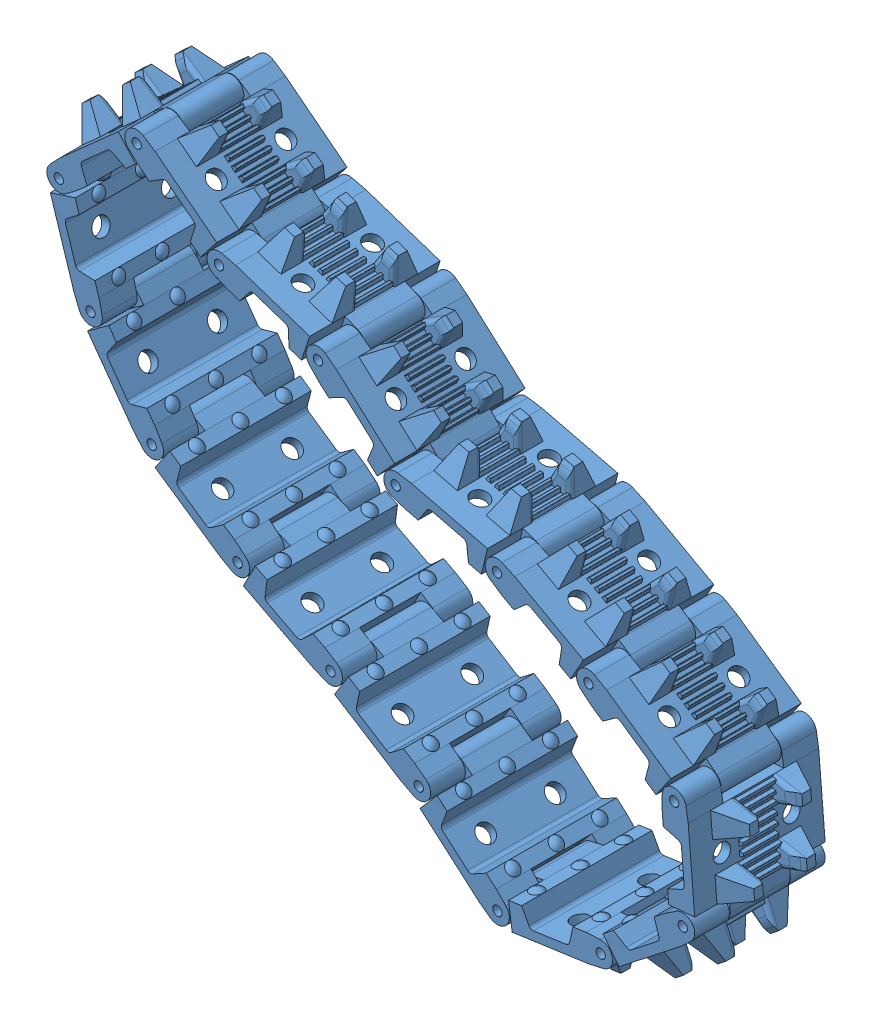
SolidWorks assembly Assemblage1.sldasm, configuration Défaut (file format 8000). Lengths in mm.
Overall size (162.13 129.48 30).
16 component instances, 1 part files, 31 mates.
Components (placement in the parent):
- Track V2.0-1: Track V2.0.SLDPRT [Défaut] at (-161.0772 34.4035 -52.2427) x (0.746642 0.665226 0) z (0 0 1) size (29.5 12.7 30)
- Track V2.0-2: Track V2.0.SLDPRT [Défaut] at (-142.6591 35.0011 -52.2427) x (0.788197 -0.615423 0) z (0 0 1) size (29.5 12.7 30)
- Track V2.0-3: Track V2.0.SLDPRT [Défaut] at (-166.3934 14.9873 -52.2427) x (-0.303624 0.952792 0) z (0 0 1) size (29.5 12.7 30)
- Track V2.0-4: Track V2.0.SLDPRT [Défaut] at (-155.7079 -6.1627 -52.2427) x (-0.586838 0.809705 0) z (0 0 1) size (29.5 12.7 30)
- Track V2.0-5: Track V2.0.SLDPRT [Défaut] at (-78.1946 -61.1357 -52.2427) x (-0.754356 0.656465 0) z (0 0 1) size (29.5 12.7 30)
- Track V2.0-6: Track V2.0.SLDPRT [Défaut] at (-97.3963 -46.8559 -52.2427) x (-0.845786 0.533522 0) z (0 0 1) size (29.5 12.7 30)
- Track V2.0-7: Track V2.0.SLDPRT [Défaut] at (-118.2154 -34.9619 -52.2427) x (-0.889137 0.457641 0) z (0 0 1) size (29.5 12.7 30)
- Track V2.0-8: Track V2.0.SLDPRT [Défaut] at (-138.7754 -22.6747 -52.2427) x (-0.824202 0.566296 0) z (0 0 1) size (29.5 12.7 30)
- Track V2.0-9: Track V2.0.SLDPRT [Défaut] at (-121.8102 23.8406 -52.2427) x (0.949218 -0.31462 0) z (0 0 1) size (29.5 12.7 30)
- Track V2.0-10: Track V2.0.SLDPRT [Défaut] at (-101.485 12.0543 -52.2427) x (0.744545 -0.667572 0) z (0 0 1) size (29.5 12.7 30)
- Track V2.0-11: Track V2.0.SLDPRT [Défaut] at (-35.9453 -58.2242 -52.2427) x (-0.786293 -0.617854 0) z (0 0 1) size (29.5 12.7 30)
- Track V2.0-12: Track V2.0.SLDPRT [Défaut] at (-57.2615 -67.3259 -52.2427) x (-0.990064 -0.14062 0) z (0 0 1) size (29.5 12.7 30)
- Track V2.0-13: Track V2.0.SLDPRT [Défaut] at (-38.3565 -20.0476 -52.2427) x (0.821358 -0.570413 0) z (0 0 1) size (29.5 12.7 30)
- Track V2.0-14: Track V2.0.SLDPRT [Défaut] at (-27.505 -38.8513 -52.2427) x (0.082936 -0.996555 0) z (0 0 1) size (29.5 12.7 30)
- Track V2.0-15: Track V2.0.SLDPRT [Défaut] at (-80.8876 1.2191 -52.2427) x (0.971907 -0.235364 0) z (0 0 1) size (29.5 12.7 30)
- Track V2.0-16: Track V2.0.SLDPRT [Défaut] at (-58.7187 -7.404 -52.2427) x (0.875496 -0.483226 0) z (0 0 1) size (29.5 12.7 30)
Mates (geometry in assembly coordinates):
- Coaxiale1: concentric aligned: cylinder of Track V2.0-5 through (-87.2468 -53.2581 -59.1427) axis (0 0 1) radius 0.935; cylinder of Track V2.0-6 through (-87.2468 -53.2581 -45.2427) axis (0 0 1) radius 1.075
- Distance1: distance = 0.1 mm anti-aligned: plane of Track V2.0-5 through (-78.1946 -61.1357 -45.3427) normal (0 0 1); plane of Track V2.0-6 through (-97.3963 -46.8559 -45.2427) normal (0 0 -1)
- Coaxiale2: concentric aligned: cylinder of Track V2.0-6 through (-107.5457 -40.4536 -59.1427) axis (0 0 1) radius 0.935; cylinder of Track V2.0-7 through (-107.5457 -40.4536 -45.2427) axis (0 0 1) radius 1.075
- Distance2: distance = 0.1 mm anti-aligned: plane of Track V2.0-6 through (-97.3963 -46.8559 -45.3427) normal (0 0 1); plane of Track V2.0-7 through (-118.2154 -34.9619 -45.2427) normal (0 0 -1)
- Coaxiale3: concentric anti-aligned: cylinder of Track V2.0-7 through (-128.885 -29.4702 -59.1427) axis (0 0 1) radius 0.935; cylinder of Track V2.0-8 through (-128.885 -29.4702 -59.2427) axis (0 0 -1) radius 1.075
- Distance3: distance = 0.1 mm anti-aligned: plane of Track V2.0-8 through (-138.7754 -22.6747 -45.2427) normal (0 0 -1); plane of Track V2.0-7 through (-118.2154 -34.9619 -45.3427) normal (0 0 1)
- Coaxiale4: concentric anti-aligned: cylinder of Track V2.0-3 through (-162.75 3.5538 -59.2427) axis (0 0 -1) radius 1.075; cylinder of Track V2.0-4 through (-162.75 3.5538 -59.1427) axis (0 0 1) radius 0.935
- Distance4: distance = 0.1 mm anti-aligned: plane of Track V2.0-4 through (-155.7079 -6.1627 -45.3427) normal (0 0 1); plane of Track V2.0-3 through (-166.3934 14.9873 -45.2427) normal (0 0 -1)
- Coaxiale5: concentric anti-aligned: cylinder of Track V2.0-1 through (-170.0369 26.4208 -59.2427) axis (0 0 -1) radius 1.075; cylinder of Track V2.0-3 through (-170.0369 26.4208 -59.1427) axis (0 0 1) radius 0.935
- Distance5: distance = 0.1 mm anti-aligned: plane of Track V2.0-3 through (-166.3934 14.9873 -45.3427) normal (0 0 1); plane of Track V2.0-1 through (-161.0772 34.4035 -45.2427) normal (0 0 -1)
- Coaxiale6: concentric anti-aligned: cylinder of Track V2.0-1 through (-152.1175 42.3862 -59.1427) axis (0 0 1) radius 0.935; cylinder of Track V2.0-2 through (-152.1175 42.3862 -59.2427) axis (0 0 -1) radius 1.075
- Distance6: distance = 0.1 mm anti-aligned: plane of Track V2.0-1 through (-161.0772 34.4035 -45.3427) normal (0 0 1); plane of Track V2.0-2 through (-142.6591 35.0011 -45.2427) normal (0 0 -1)
- Coaxiale7: concentric anti-aligned: cylinder of Track V2.0-4 through (-148.6659 -15.8791 -59.2427) axis (0 0 -1) radius 1.075; cylinder of Track V2.0-8 through (-148.6659 -15.8791 -59.1427) axis (0 0 1) radius 0.935
- Distance7: distance = 0.1 mm anti-aligned: plane of Track V2.0-8 through (-138.7754 -22.6747 -45.3427) normal (0 0 1); plane of Track V2.0-4 through (-155.7079 -6.1627 -45.2427) normal (0 0 -1)
- Coaxiale8: concentric anti-aligned: cylinder of Track V2.0-9 through (-110.4196 20.0652 -59.1427) axis (0 0 1) radius 0.935; cylinder of Track V2.0-10 through (-110.4196 20.0652 -59.2427) axis (0 0 -1) radius 1.075
- Distance8: distance = 0.1 mm anti-aligned: plane of Track V2.0-9 through (-121.8102 23.8406 -45.3427) normal (0 0 1); plane of Track V2.0-10 through (-101.485 12.0543 -45.2427) normal (0 0 -1)
- Coaxiale9: concentric anti-aligned: cylinder of Track V2.0-10 through (-92.5505 4.0435 -59.1427) axis (0 0 1) radius 0.935; cylinder of Track V2.0-15 through (-92.5505 4.0435 -59.2427) axis (0 0 -1) radius 1.075
- Distance9: distance = 0.1 mm anti-aligned: plane of Track V2.0-10 through (-101.485 12.0543 -45.3427) normal (0 0 1); plane of Track V2.0-15 through (-80.8876 1.2191 -45.2427) normal (0 0 -1)
- Coaxiale10: concentric anti-aligned: cylinder of Track V2.0-15 through (-69.2247 -1.6053 -59.1427) axis (0 0 1) radius 0.935; cylinder of Track V2.0-16 through (-69.2247 -1.6053 -59.2427) axis (0 0 -1) radius 1.075
- Distance10: distance = 0.1 mm anti-aligned: plane of Track V2.0-15 through (-80.8876 1.2191 -45.3427) normal (0 0 1); plane of Track V2.0-16 through (-58.7187 -7.404 -45.2427) normal (0 0 -1)
- Coaxiale11: concentric anti-aligned: cylinder of Track V2.0-2 through (-133.2008 27.6161 -59.1427) axis (0 0 1) radius 0.935; cylinder of Track V2.0-9 through (-133.2008 27.6161 -59.2427) axis (0 0 -1) radius 1.075
- Distance11: distance = 0.1 mm anti-aligned: plane of Track V2.0-2 through (-142.6591 35.0011 -45.3427) normal (0 0 1); plane of Track V2.0-9 through (-121.8102 23.8406 -45.2427) normal (0 0 -1)
- Coaxiale12: concentric aligned: cylinder of Track V2.0-13 through (-28.5002 -26.8926 -59.1427) axis (0 0 1) radius 0.935; cylinder of Track V2.0-14 through (-28.5002 -26.8926 -45.2427) axis (0 0 1) radius 1.075
- Coaxiale13: concentric aligned: cylinder of Track V2.0-11 through (-26.5097 -50.8099 -45.2427) axis (0 0 1) radius 1.075; cylinder of Track V2.0-14 through (-26.5097 -50.8099 -59.1427) axis (0 0 1) radius 0.935
- Coaxiale14: concentric aligned: cylinder of Track V2.0-11 through (-45.3808 -65.6384 -59.1427) axis (0 0 1) radius 0.935; circle of Track V2.0-12
- Distance12: distance = 0.1 mm anti-aligned: plane of Track V2.0-13 through (-38.3565 -20.0476 -45.3427) normal (0 0 1); plane of Track V2.0-14 through (-27.505 -38.8513 -45.2427) normal (0 0 -1)
- Distance13: distance = 0.1 mm anti-aligned: plane of Track V2.0-14 through (-27.505 -38.8513 -59.1427) normal (0 0 -1); plane of Track V2.0-11 through (-35.9453 -58.2242 -59.2427) normal (0 0 1)
- Distance14: distance = 0.1 mm anti-aligned: plane of Track V2.0-11 through (-35.9453 -58.2242 -45.3427) normal (0 0 1); plane of Track V2.0-12 through (-57.2615 -67.3259 -45.2427) normal (0 0 -1)
- Coaxiale15: concentric anti-aligned: cylinder of Track V2.0-13 through (-48.2128 -13.2027 -59.2427) axis (0 0 -1) radius 1.075; cylinder of Track V2.0-16 through (-48.2128 -13.2027 -59.1427) axis (0 0 1) radius 0.935
- Distance15: distance = 0.1 mm anti-aligned: plane of Track V2.0-13 through (-38.3565 -20.0476 -45.2427) normal (0 0 -1); plane of Track V2.0-16 through (-58.7187 -7.404 -45.3427) normal (0 0 1)
- Coaxiale16: concentric aligned: cylinder of Track V2.0-5 through (-69.1423 -69.0133 -45.2427) axis (0 0 1) radius 1.075; cylinder of Track V2.0-12 through (-69.1423 -69.0133 -59.1427) axis (0 0 1) radius 0.935
